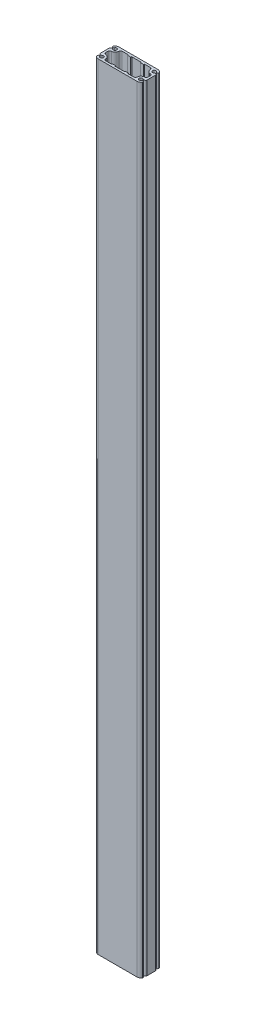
from build123d import *

# Parameters (mm, degrees)
SALIENTE_EXTRUIR1_DEPTH = 3000


with BuildPart() as part:
    # Croquis2 → Saliente-Extruir1 (new body)
    with BuildSketch(Plane(origin=(0, 0, 0), x_dir=(1, 0, 0), z_dir=(0, 1, 0))):
        with BuildLine():
            Line((90, -15.820430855), (90, 15.820430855))
            ThreePointArc((90, 15.820430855), (86.377431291, 21.479059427), (79.722019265, 20.557879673))
            ThreePointArc((79.722019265, 20.557879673), (69.104845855, 26.662756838), (81.19143785, 28.639671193))
            ThreePointArc((81.19143785, 28.639671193), (86.625966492, 27.069353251), (88.196284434, 32.503881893))
            ThreePointArc((88.196284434, 32.503881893), (82.872032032, 37.986118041), (75.5, 40))
            Line((75.5, 40), (-75.5, 40))
            ThreePointArc((-75.5, 40), (-82.872032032, 37.986118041), (-88.196284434, 32.503881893))
            ThreePointArc((-88.196284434, 32.503881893), (-86.625966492, 27.069353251), (-81.19143785, 28.639671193))
            ThreePointArc((-81.19143785, 28.639671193), (-69.104845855, 26.662756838), (-79.722019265, 20.557879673))
            ThreePointArc((-79.722019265, 20.557879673), (-86.377431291, 21.479059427), (-90, 15.820430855))
            Line((-90, 15.820430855), (-90, -15.820430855))
            ThreePointArc((-90, -15.820430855), (-86.377431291, -21.479059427), (-79.722019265, -20.557879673))
            ThreePointArc((-79.722019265, -20.557879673), (-69.104845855, -26.662756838), (-81.19143785, -28.639671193))
            ThreePointArc((-81.19143785, -28.639671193), (-86.625966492, -27.069353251), (-88.196284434, -32.503881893))
            ThreePointArc((-88.196284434, -32.503881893), (-82.872032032, -37.986118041), (-75.5, -40))
            Line((-75.5, -40), (75.5, -40))
            ThreePointArc((75.5, -40), (82.872032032, -37.986118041), (88.196284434, -32.503881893))
            ThreePointArc((88.196284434, -32.503881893), (86.625966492, -27.069353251), (81.19143785, -28.639671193))
            ThreePointArc((81.19143785, -28.639671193), (69.104845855, -26.662756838), (79.722019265, -20.557879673))
            ThreePointArc((79.722019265, -20.557879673), (86.377431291, -21.479059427), (90, -15.820430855))
        make_face()
        with BuildLine():
            Line((-17.482701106, 32), (17.482701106, 32))
            Line((17.482701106, 32), (20, 29))
            Line((20, 29), (30, 29))
            Line((30, 29), (32.517298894, 32))
            Line((32.517298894, 32), (54.5, 32))
            ThreePointArc((54.5, 32), (59.096194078, 30.096194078), (61, 25.5))
            ThreePointArc((61, 25.5), (65.246951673, 15.246951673), (75.5, 11))
            ThreePointArc((75.5, 11), (80.096194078, 9.096194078), (82, 4.5))
            Line((82, 4.5), (82, -4.5))
            ThreePointArc((82, -4.5), (80.096194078, -9.096194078), (75.5, -11))
            ThreePointArc((75.5, -11), (65.246951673, -15.246951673), (61, -25.5))
            ThreePointArc((61, -25.5), (59.096194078, -30.096194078), (54.5, -32))
            Line((54.5, -32), (32.517298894, -32))
            Line((32.517298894, -32), (30, -29))
            Line((30, -29), (20, -29))
            Line((20, -29), (17.482701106, -32))
            Line((17.482701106, -32), (-17.482701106, -32))
            Line((-17.482701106, -32), (-20, -29))
            Line((-20, -29), (-30, -29))
            Line((-30, -29), (-32.517298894, -32))
            Line((-32.517298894, -32), (-54.5, -32))
            ThreePointArc((-54.5, -32), (-59.096194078, -30.096194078), (-61, -25.5))
            ThreePointArc((-61, -25.5), (-65.246951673, -15.246951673), (-75.5, -11))
            ThreePointArc((-75.5, -11), (-80.096194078, -9.096194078), (-82, -4.5))
            Line((-82, -4.5), (-82, 4.5))
            ThreePointArc((-82, 4.5), (-80.096194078, 9.096194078), (-75.5, 11))
            ThreePointArc((-75.5, 11), (-65.246951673, 15.246951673), (-61, 25.5))
            ThreePointArc((-61, 25.5), (-59.096194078, 30.096194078), (-54.5, 32))
            Line((-54.5, 32), (-32.517298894, 32))
            Line((-32.517298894, 32), (-30, 29))
            Line((-30, 29), (-20, 29))
            Line((-20, 29), (-17.482701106, 32))
        make_face(mode=Mode.SUBTRACT)
    extrude(amount=SALIENTE_EXTRUIR1_DEPTH)


solid = part.part
